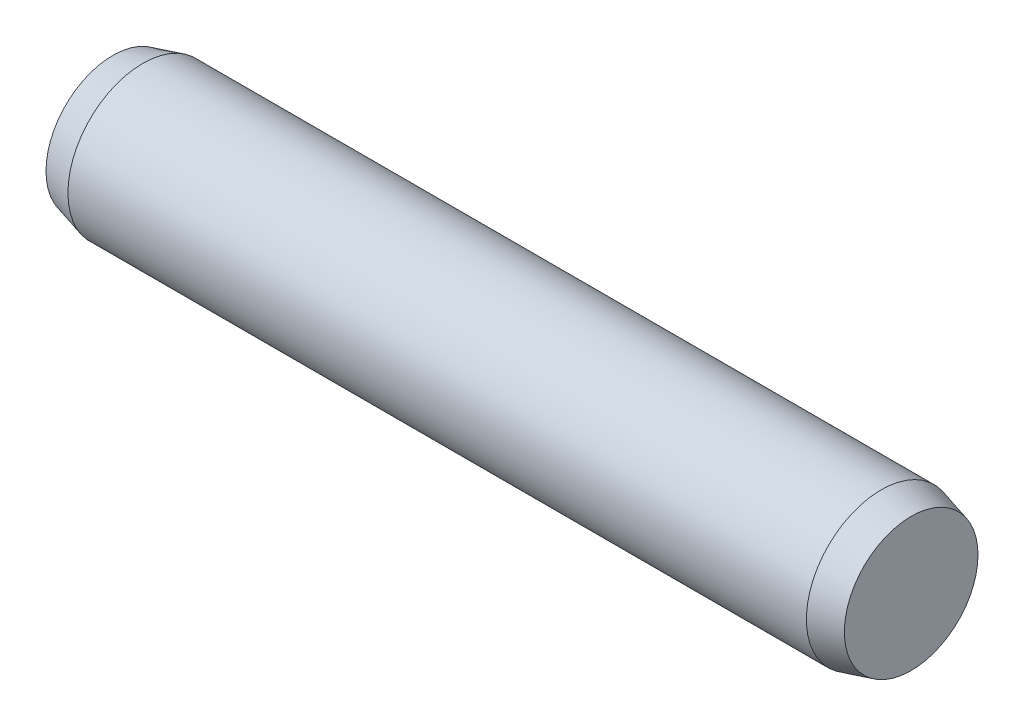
from build123d import *

# Parameters (mm, degrees)
EXTRUDE1_DEPTH      = 3.7
EXTRUDE1_DEPTH_BACK = 3.7
SKETCH2_R           = 0.75
SKETCH3_R           = 0.75
EXTRUDE2_DEPTH      = 0.3
EXTRUDE2_TAPER      = 15
SKETCH4_R           = 0.75
EXTRUDE3_DEPTH      = 0.3
EXTRUDE3_TAPER      = 15


with BuildPart() as part:
    # Sketch2 → Extrude1 (new, two sides: drawn at the far end of the back side and taken through both)
    with BuildSketch(Plane(origin=(0, 0, 0), x_dir=(0, 0, -1), z_dir=(1, 0, 0)).offset(-EXTRUDE1_DEPTH_BACK)):
        Circle(SKETCH2_R)
    extrude(amount=EXTRUDE1_DEPTH + EXTRUDE1_DEPTH_BACK)

    # Sketch3 → Extrude2 (add)
    with BuildSketch(Plane(origin=(3.7, 0, 0), x_dir=(0, 0, -1), z_dir=(1, 0, 0))):
        Circle(SKETCH3_R)
    extrude(amount=EXTRUDE2_DEPTH, taper=EXTRUDE2_TAPER)

    # Sketch4 → Extrude3 (add)
    with BuildSketch(Plane.ZY.offset(3.7)):
        with Locations(Location((0, 0, 0), (0, 0, 180))):
            Circle(SKETCH4_R)
    extrude(amount=EXTRUDE3_DEPTH, taper=EXTRUDE3_TAPER)


solid = part.part
